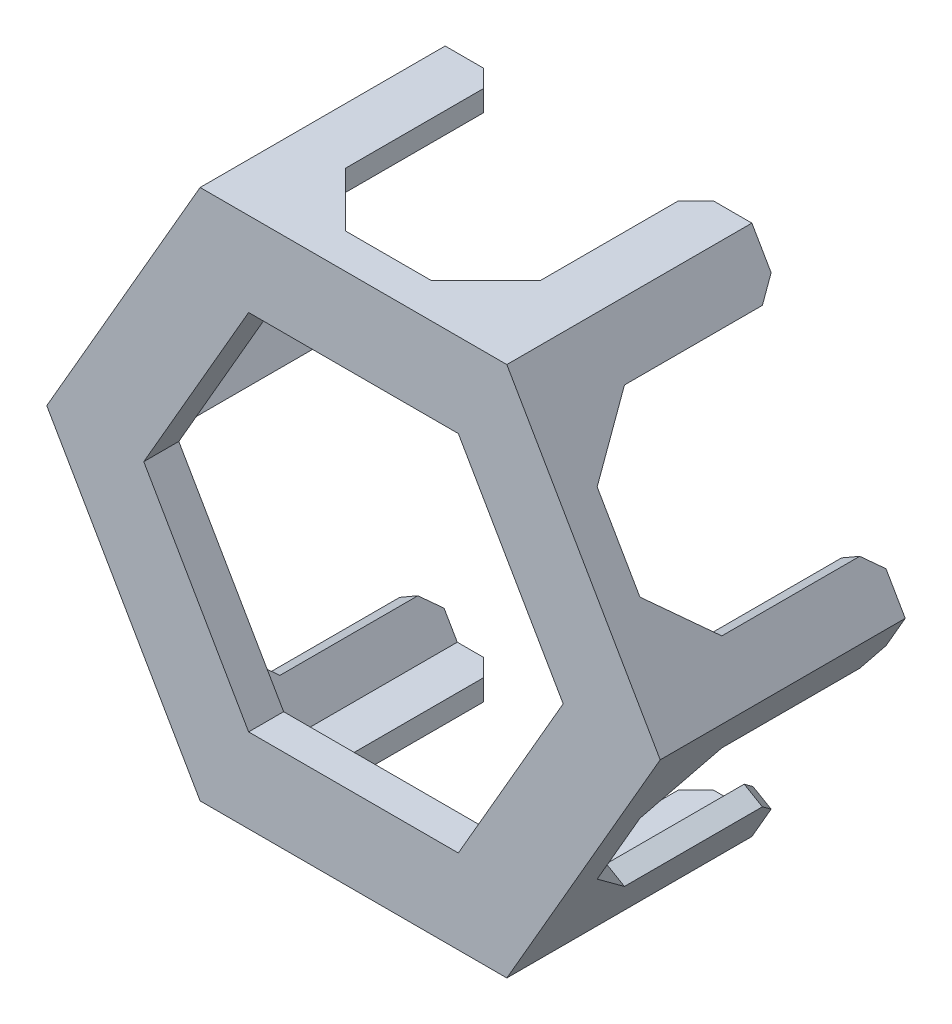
from build123d import *

# Parameters (mm, degrees)
SALIENTE_EXTRUIR1_DEPTH    = 5
SALIENTE_EXTRUIR2_DEPTH    = 30
REDONDEO1_SIZE             = 7.8
REDONDEO2_SIZE             = 2.5
MATRIZC1_COUNT             = 6
REDONDEO1_OF_MATRIZC1_SIZE = 7.8
REDONDEO2_OF_MATRIZC1_SIZE = 2.5


with BuildPart() as part:
    # Croquis1 → Saliente-Extruir1 (new body)
    # profile 1 of 2: a face of its own
    with BuildSketch(Plane.XY):
        Polygon((43.810511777, 0), (21.905255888, -37.941016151), (-21.905255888, -37.941016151), (-43.810511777, 0), (-21.905255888, 37.941016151), (21.905255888, 37.941016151), align=None)
        Polygon((20.173205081, 34.941016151), (40.346410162, 0), (20.173205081, -34.941016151), (-20.173205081, -34.941016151), (-40.346410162, 0), (-20.173205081, 34.941016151), align=None, mode=Mode.SUBTRACT)
    # profile 2 of 2: a face of its own
    with BuildSketch(Plane.XY):
        Polygon((40.346410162, 0), (20.173205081, -34.941016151), (-20.173205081, -34.941016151), (-40.346410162, 0), (-20.173205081, 34.941016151), (20.173205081, 34.941016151), align=None)
        Polygon((-14.977052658, 25.941016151), (14.977052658, 25.941016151), (29.954105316, 0), (14.977052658, -25.941016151), (-14.977052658, -25.941016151), (-29.954105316, 0), align=None, mode=Mode.SUBTRACT)
    extrude(amount=SALIENTE_EXTRUIR1_DEPTH)

    # Croquis2 → Saliente-Extruir2 (add)
    with BuildSketch(Plane(origin=(0, 0, 0), x_dir=(-1, 0, 0), z_dir=(0, 0, -1))):
        Polygon((-39.810511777, -6.92820323), (-37.212435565, -5.42820323), (-40.346410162, 0), (-37.212435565, 5.42820323), (-39.810511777, 6.92820323), (-43.810511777, 0), align=None)
    saliente_extruir2 = extrude(amount=SALIENTE_EXTRUIR2_DEPTH)

    # Redondeo1
    redondeo1_edges = [part.edges().sort_by_distance(p)[0] for p in [
        (38.511473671, -6.17820323, 0),
        (38.511473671, 6.17820323, 0),
    ]]
    chamfer(redondeo1_edges, length=REDONDEO1_SIZE)

    # Redondeo2
    redondeo2_edges = [part.edges().sort_by_distance(p)[0] for p in [
        (38.511473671, -6.17820323, -30),
        (38.511473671, 6.17820323, -30),
    ]]
    chamfer(redondeo2_edges, length=REDONDEO2_SIZE)

    # MatrizC1: Saliente-Extruir2 ×6 about axis
    matrizc1_axis = Axis((0, 0, 0), (0, 0, 1))
    for i in range(1, MATRIZC1_COUNT):
        add(saliente_extruir2.rotate(matrizc1_axis, i * 360 / MATRIZC1_COUNT))

    # Redondeo1 of MatrizC1
    redondeo1_of_matrizc1_edges = [part.edges().sort_by_distance(p)[0] for p in [
        (24.606217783, 30.262812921, 0),
        (13.905255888, 36.441016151, 0),
        (-13.905255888, 36.441016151, 0),
        (-24.606217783, 30.262812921, 0),
        (-38.511473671, 6.17820323, 0),
        (-38.511473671, -6.17820323, 0),
        (-24.606217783, -30.262812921, 0),
        (-13.905255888, -36.441016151, 0),
        (13.905255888, -36.441016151, 0),
        (24.606217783, -30.262812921, 0),
    ]]
    chamfer(redondeo1_of_matrizc1_edges, length=REDONDEO1_OF_MATRIZC1_SIZE)

    # Redondeo2 of MatrizC1
    redondeo2_of_matrizc1_edges = [part.edges().sort_by_distance(p)[0] for p in [
        (24.606217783, 30.262812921, -30),
        (13.905255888, 36.441016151, -30),
        (-13.905255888, 36.441016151, -30),
        (-24.606217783, 30.262812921, -30),
        (-38.511473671, 6.17820323, -30),
        (-38.511473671, -6.17820323, -30),
        (-24.606217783, -30.262812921, -30),
        (-13.905255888, -36.441016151, -30),
        (13.905255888, -36.441016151, -30),
        (24.606217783, -30.262812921, -30),
    ]]
    chamfer(redondeo2_of_matrizc1_edges, length=REDONDEO2_OF_MATRIZC1_SIZE)


solid = part.part
